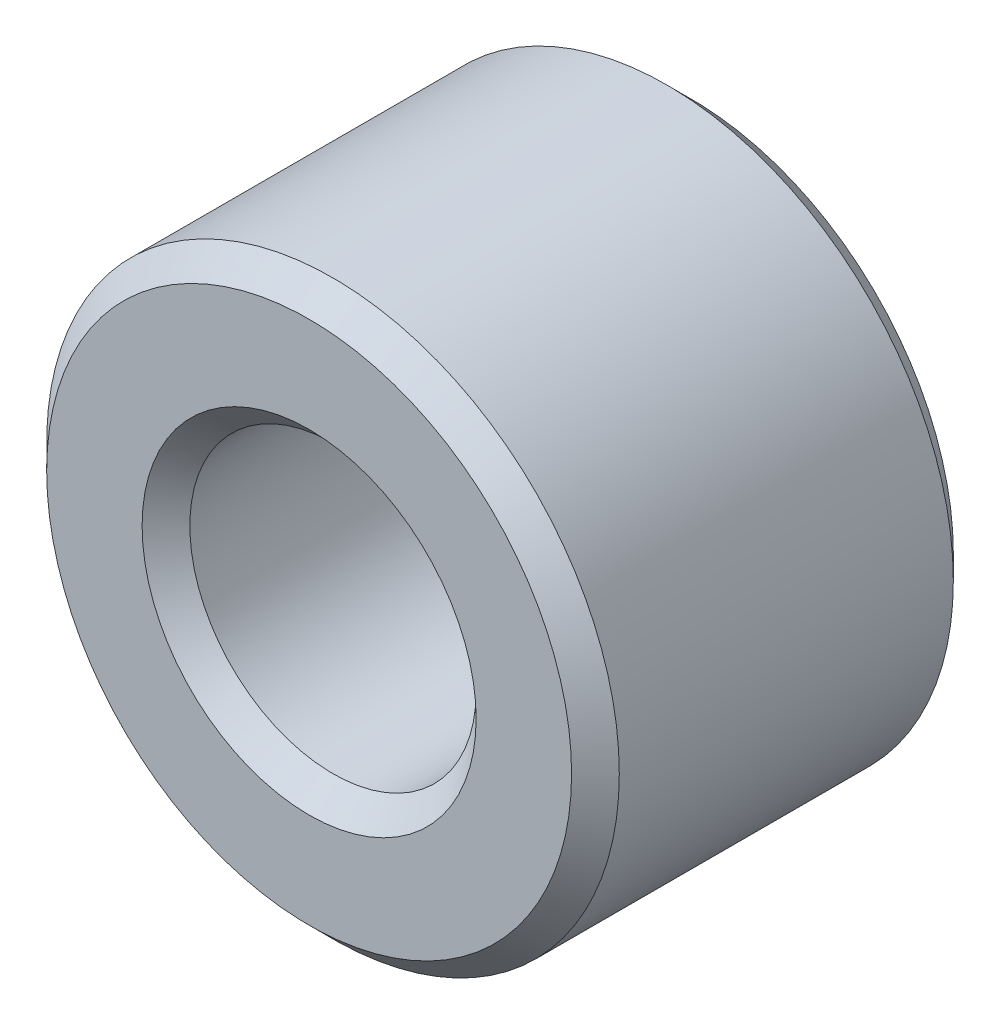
from build123d import *

# Parameters (mm, degrees)
ESQUISSE1_R        = 3
ESQUISSE1_R_2      = 1.5
BOSS_EXTRU_1_DEPTH = 4
CHANFREIN1_SIZE    = 0.25


with BuildPart() as part:
    # Esquisse1 → Boss.-Extru.1 (new body)
    with BuildSketch(Plane.XY):
        Circle(ESQUISSE1_R)
        Circle(ESQUISSE1_R_2, mode=Mode.SUBTRACT)
    extrude(amount=BOSS_EXTRU_1_DEPTH)

    # Chanfrein1
    chanfrein1_edges = [part.edges().sort_by_distance(p)[0] for p in [
        (-3, 0, 0),
        (-3, 0, 4),
        (-1.5, 0, 0),
        (-1.5, 0, 4),
    ]]
    chamfer(chanfrein1_edges, length=CHANFREIN1_SIZE)


solid = part.part
